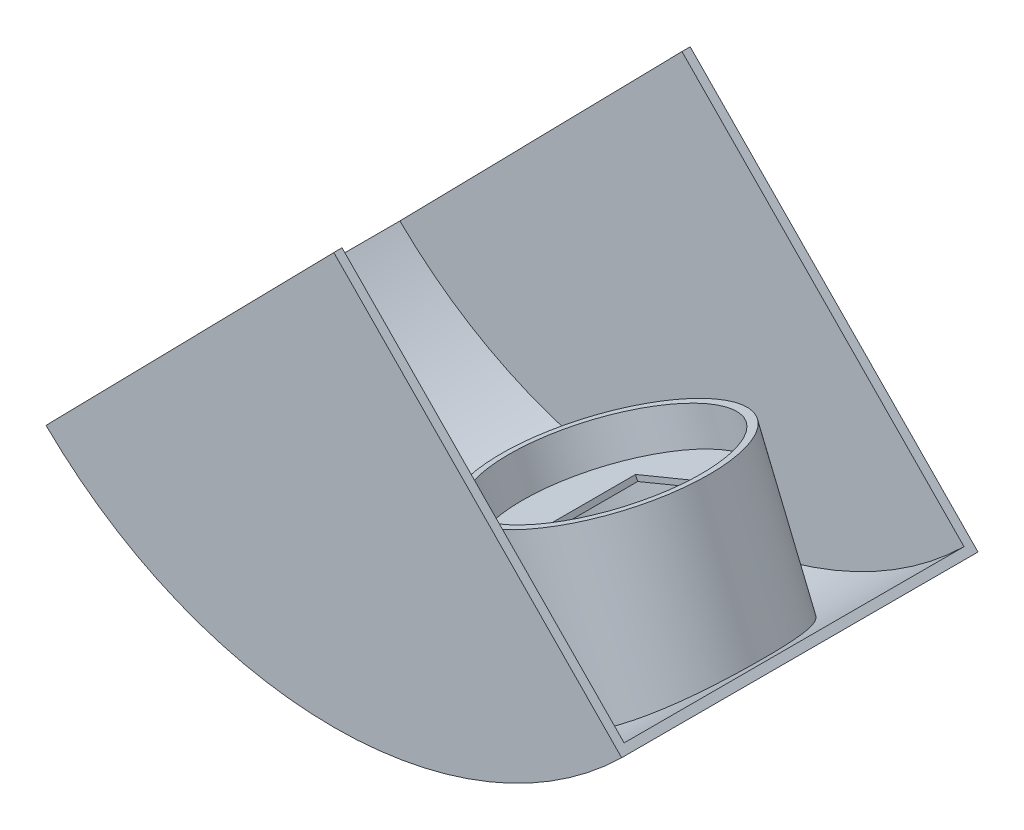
from build123d import *

# Parameters (mm, degrees)
EXTRUSION1_DEPTH             = 65
ENL_V_MAT_EXTRU_1_DEPTH      = 62
EXTRUSION2_REACH             = 215.857
EXTRUSION2_END_RADIUS        = 147
ESQUISSE4_R                  = 41
EXTRUSION2_DIRECTION_2_DEPTH = 50
ENL_V_MAT_EXTRU_2_REACH      = 176.13
ENL_V_MAT_EXTRU_2_END_RADIUS = 150
ESQUISSE5_R                  = 38
EXTRUSION3_START             = 2
ESQUISSE6_R                  = 38
EXTRUSION3_DEPTH             = 2
ENL_V_MAT_EXTRU_3_REACH      = 185.978
ESQUISSE7_W                  = 30
ESQUISSE7_H                  = 40


with BuildPart() as part:
    # Esquisse1 → Extrusion1 (new, symmetric)
    with BuildSketch(Plane.XY):
        with BuildLine():
            Line((0, 0), (-105, -107.121426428))
            ThreePointArc((-105, -107.121426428), (0, -150), (105, -107.121426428))
            Line((105, -107.121426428), (0, 0))
        make_face()
    extrude(amount=EXTRUSION1_DEPTH, both=True)

    # Esquisse2 → Enl_v. mat.-Extru.1 (cut, symmetric)
    with BuildSketch(Plane.XY):
        with BuildLine():
            Line((-102.9, -104.9789979), (0, 0))
            Line((0, 0), (102.9, -104.9789979))
            ThreePointArc((102.9, -104.9789979), (0, -147), (-102.9, -104.9789979))
        make_face()
    extrude(amount=ENL_V_MAT_EXTRU_1_DEPTH, both=True, mode=Mode.SUBTRACT)

    # Extrusion2: up to this cylinder (the profile starts inside it)
    extrusion2_end = Plane(origin=(0, 0, 0), z_dir=(0, 0, 1)) * Cylinder(EXTRUSION2_END_RADIUS, 726.714, mode=Mode.PRIVATE)
    # Esquisse4 → Extrusion2 (add, up to the surface)
    with BuildSketch(Plane(origin=(53.058941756, -128.558630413, 0), x_dir=(0.9243663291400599, 0.3815060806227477, 0), z_dir=(0.3815060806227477, -0.9243663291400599, 0)), mode=Mode.PRIVATE) as extrusion2_sk1:
        Circle(ESQUISSE4_R)
    extrusion2_tool1 = extrude(extrusion2_sk1.sketch, amount=EXTRUSION2_REACH, mode=Mode.PRIVATE) & extrusion2_end
    add(extrusion2_tool1.solids().sort_by_distance((53.058942, -128.55863, 0))[0])

    # Esquisse4 → Extrusion2 direction 2 (add)
    with BuildSketch(Plane(origin=(53.058941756, -128.558630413, 0), x_dir=(0.9243663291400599, 0.3815060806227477, 0), z_dir=(0.3815060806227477, -0.9243663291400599, 0))):
        Circle(ESQUISSE4_R)
    extrude(amount=-EXTRUSION2_DIRECTION_2_DEPTH)

    # Enl_v. mat.-Extru.2: up to this cylinder (the profile starts inside it)
    enl_v_mat_extru_2_end = Plane(origin=(0, 0, 0), z_dir=(0, 0, -1)) * Cylinder(ENL_V_MAT_EXTRU_2_END_RADIUS, 653.26, mode=Mode.PRIVATE)
    # Esquisse5 → Enl_v. mat.-Extru.2 (cut, up to the surface)
    with BuildSketch(Plane(origin=(33.983637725, -82.340313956, 0), x_dir=(-0.9243663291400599, -0.38150608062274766, 0), z_dir=(-0.38150608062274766, 0.9243663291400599, 0)), mode=Mode.PRIVATE) as enl_v_mat_extru_2_sk1:
        Circle(ESQUISSE5_R)
    enl_v_mat_extru_2_tool1 = extrude(enl_v_mat_extru_2_sk1.sketch, amount=-ENL_V_MAT_EXTRU_2_REACH, mode=Mode.PRIVATE) & enl_v_mat_extru_2_end
    add(enl_v_mat_extru_2_tool1.solids().sort_by_distance((33.983638, -82.340314, 0))[0], mode=Mode.SUBTRACT)

    # Esquisse6 → Extrusion3 (add)
    with BuildSketch(Plane(origin=(39.706228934, -96.205808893, 0), x_dir=(-0.9243663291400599, -0.38150608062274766, 0), z_dir=(-0.38150608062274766, 0.9243663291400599, 0)).offset(EXTRUSION3_START)):
        Circle(ESQUISSE6_R)
    extrude(amount=-EXTRUSION3_DEPTH)

    # Esquisse7 → Enl_v. mat.-Extru.3 (cut, up to next)
    with BuildSketch(Plane(origin=(38.943216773, -94.357076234, 0), x_dir=(-0.92436632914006, -0.38150608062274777, 0), z_dir=(-0.38150608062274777, 0.92436632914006, 0)), mode=Mode.PRIVATE) as enl_v_mat_extru_3_sk1:
        Rectangle(ESQUISSE7_W, ESQUISSE7_H)
    enl_v_mat_extru_3_tool1 = extrude(enl_v_mat_extru_3_sk1.sketch, amount=-ENL_V_MAT_EXTRU_3_REACH, mode=Mode.PRIVATE) & part.part
    add(enl_v_mat_extru_3_tool1.solids().sort_by_distance((38.943217, -94.357076, 0))[0], mode=Mode.SUBTRACT)


solid = part.part
